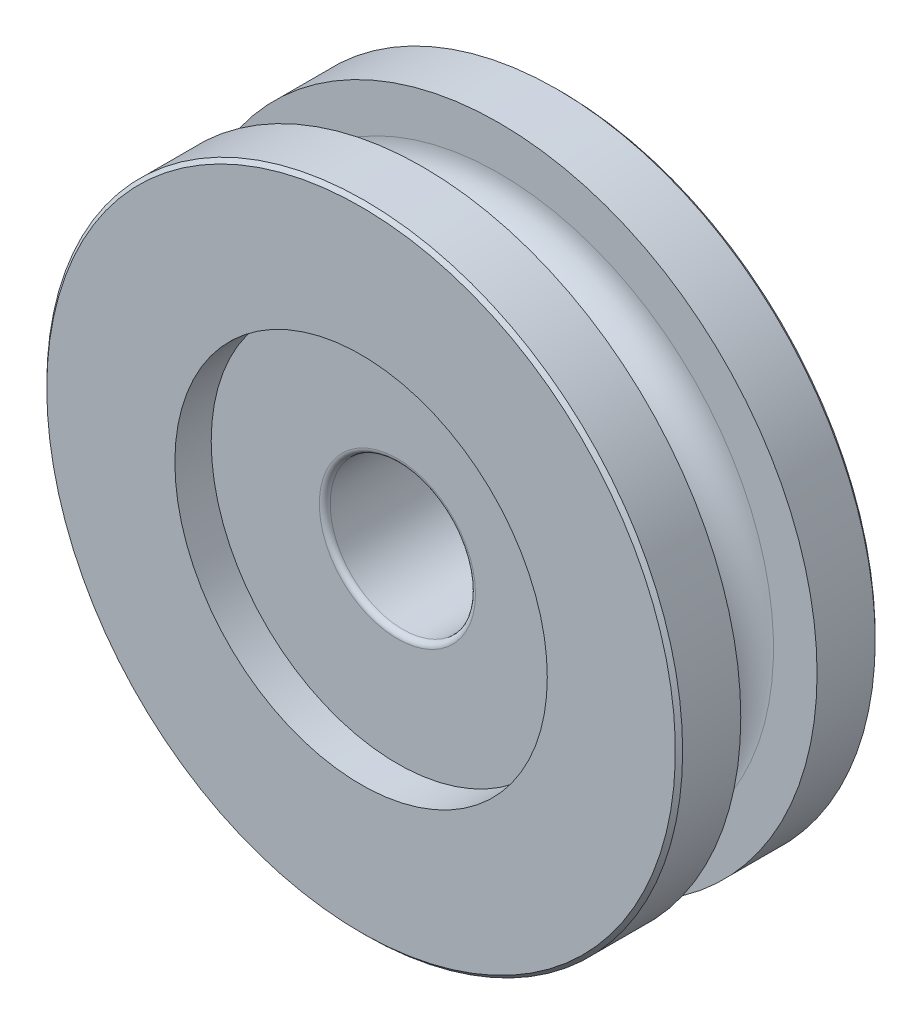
ISO-10303-21;
HEADER;
FILE_DESCRIPTION(('STEP AP214'),'2;1');
FILE_NAME('part.step','',(''),(''),'','','');
FILE_SCHEMA(('AUTOMOTIVE_DESIGN { 1 0 10303 214 1 1 1 1 }'));
ENDSEC;
DATA;
#1=APPLICATION_CONTEXT('core data for automotive mechanical design processes');
#2=APPLICATION_PROTOCOL_DEFINITION('international standard','automotive_design',2000,#1);
#3=PRODUCT_CONTEXT('',#1,'mechanical');
#4=PRODUCT('Part','Part','',(#3));
#5=PRODUCT_RELATED_PRODUCT_CATEGORY('part','',(#4));
#6=PRODUCT_DEFINITION_FORMATION('','',#4);
#7=PRODUCT_DEFINITION_CONTEXT('part definition',#1,'design');
#8=PRODUCT_DEFINITION('design','',#6,#7);
#9=PRODUCT_DEFINITION_SHAPE('','',#8);
#10=(LENGTH_UNIT() NAMED_UNIT(*) SI_UNIT(.MILLI.,.METRE.));
#11=(NAMED_UNIT(*) PLANE_ANGLE_UNIT() SI_UNIT($,.RADIAN.));
#12=(NAMED_UNIT(*) SI_UNIT($,.STERADIAN.) SOLID_ANGLE_UNIT());
#13=UNCERTAINTY_MEASURE_WITH_UNIT(LENGTH_MEASURE(1.E-05),#10,'distance_accuracy_value','');
#14=(GEOMETRIC_REPRESENTATION_CONTEXT(3) GLOBAL_UNCERTAINTY_ASSIGNED_CONTEXT((#13)) GLOBAL_UNIT_ASSIGNED_CONTEXT((#10,
#11,#12)) REPRESENTATION_CONTEXT('',''));
#15=CARTESIAN_POINT('',(0.,0.,0.));
#16=DIRECTION('',(0.,0.,1.));
#17=DIRECTION('',(1.,0.,0.));
#18=AXIS2_PLACEMENT_3D('',#15,#16,#17);
#19=CARTESIAN_POINT('',(0.,4.3,-3.5));
#20=DIRECTION('',(0.,0.,1.));
#21=DIRECTION('',(1.,0.,0.));
#22=AXIS2_PLACEMENT_3D('',#19,#20,#21);
#23=PLANE('',#22);
#24=CARTESIAN_POINT('',(2.4,-9.28614557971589,-3.5));
#25=DIRECTION('',(0.,0.,1.));
#26=DIRECTION('',(1.,0.,0.));
#27=AXIS2_PLACEMENT_3D('',#24,#25,#26);
#28=CIRCLE('',#27,1.);
#29=CARTESIAN_POINT('',(3.4,-9.28614557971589,-3.5));
#30=VERTEX_POINT('',#29);
#31=EDGE_CURVE('E127',#30,#30,#28,.T.);
#32=ORIENTED_EDGE('',*,*,#31,.F.);
#33=EDGE_LOOP('',(#32));
#34=FACE_BOUND('',#33,.T.);
#35=ADVANCED_FACE('F14',(#34),#23,.F.);
#36=CARTESIAN_POINT('',(-2.4,-9.28614557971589,-3.5));
#37=DIRECTION('',(0.,0.,-1.));
#38=DIRECTION('',(1.,0.,0.));
#39=AXIS2_PLACEMENT_3D('',#36,#37,#38);
#40=CIRCLE('',#39,1.);
#41=CARTESIAN_POINT('',(-1.4,-9.28614557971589,-3.5));
#42=VERTEX_POINT('',#41);
#43=EDGE_CURVE('E111',#42,#42,#40,.T.);
#44=ORIENTED_EDGE('',*,*,#43,.T.);
#45=EDGE_LOOP('',(#44));
#46=FACE_BOUND('',#45,.T.);
#47=ADVANCED_FACE('F239',(#46),#23,.F.);
#48=CARTESIAN_POINT('',(0.,15.1,2.1));
#49=DIRECTION('',(0.,0.,-1.));
#50=DIRECTION('',(-1.,0.,0.));
#51=AXIS2_PLACEMENT_3D('',#48,#49,#50);
#52=PLANE('',#51);
#53=CARTESIAN_POINT('',(0.,0.,2.1));
#54=DIRECTION('',(0.,0.,-1.));
#55=DIRECTION('',(-1.,0.,0.));
#56=AXIS2_PLACEMENT_3D('',#53,#54,#55);
#57=CIRCLE('',#56,17.5);
#58=CARTESIAN_POINT('',(-17.5,0.,2.1));
#59=VERTEX_POINT('',#58);
#60=EDGE_CURVE('E150',#59,#59,#57,.T.);
#61=ORIENTED_EDGE('',*,*,#60,.T.);
#62=EDGE_LOOP('',(#61));
#63=FACE_BOUND('',#62,.T.);
#64=CARTESIAN_POINT('',(0.,0.,2.1));
#65=DIRECTION('',(0.,0.,-1.));
#66=DIRECTION('',(-1.,0.,0.));
#67=AXIS2_PLACEMENT_3D('',#64,#65,#66);
#68=CIRCLE('',#67,15.1);
#69=CARTESIAN_POINT('',(-15.1,0.,2.1));
#70=VERTEX_POINT('',#69);
#71=EDGE_CURVE('E153',#70,#70,#68,.T.);
#72=ORIENTED_EDGE('',*,*,#71,.F.);
#73=EDGE_LOOP('',(#72));
#74=FACE_BOUND('',#73,.T.);
#75=ADVANCED_FACE('F233',(#63,#74),#52,.T.);
#76=CARTESIAN_POINT('',(0.,0.,-3.2));
#77=DIRECTION('',(0.,0.,-1.));
#78=DIRECTION('',(-1.,0.,0.));
#79=AXIS2_PLACEMENT_3D('',#76,#77,#78);
#80=CYLINDRICAL_SURFACE('',#79,17.5);
#81=CARTESIAN_POINT('',(0.,0.,5.3));
#82=DIRECTION('',(0.,0.,-1.));
#83=DIRECTION('',(-1.,0.,0.));
#84=AXIS2_PLACEMENT_3D('',#81,#82,#83);
#85=CIRCLE('',#84,17.5);
#86=CARTESIAN_POINT('',(-17.5,0.,5.3));
#87=VERTEX_POINT('',#86);
#88=EDGE_CURVE('E147',#87,#87,#85,.T.);
#89=ORIENTED_EDGE('',*,*,#88,.T.);
#90=EDGE_LOOP('',(#89));
#91=FACE_BOUND('',#90,.T.);
#92=ORIENTED_EDGE('',*,*,#60,.F.);
#93=EDGE_LOOP('',(#92));
#94=FACE_BOUND('',#93,.T.);
#95=ADVANCED_FACE('F230',(#91,#94),#80,.T.);
#96=CARTESIAN_POINT('',(0.,0.,0.));
#97=DIRECTION('',(0.,0.,-1.));
#98=DIRECTION('',(-1.,0.,0.));
#99=AXIS2_PLACEMENT_3D('',#96,#97,#98);
#100=TOROIDAL_SURFACE('',#99,15.1,2.1);
#101=ORIENTED_EDGE('',*,*,#71,.T.);
#102=EDGE_LOOP('',(#101));
#103=FACE_BOUND('',#102,.T.);
#104=CARTESIAN_POINT('',(0.,0.,-2.1));
#105=DIRECTION('',(0.,0.,-1.));
#106=DIRECTION('',(-1.,0.,0.));
#107=AXIS2_PLACEMENT_3D('',#104,#105,#106);
#108=CIRCLE('',#107,15.1);
#109=CARTESIAN_POINT('',(-15.1,0.,-2.1));
#110=VERTEX_POINT('',#109);
#111=EDGE_CURVE('E156',#110,#110,#108,.T.);
#112=ORIENTED_EDGE('',*,*,#111,.F.);
#113=EDGE_LOOP('',(#112));
#114=FACE_BOUND('',#113,.T.);
#115=ADVANCED_FACE('F226',(#103,#114),#100,.F.);
#116=CARTESIAN_POINT('',(0.,0.,5.3));
#117=DIRECTION('',(0.,0.,-1.));
#118=DIRECTION('',(-1.,0.,0.));
#119=AXIS2_PLACEMENT_3D('',#116,#117,#118);
#120=CONICAL_SURFACE('',#119,17.5,0.785398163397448);
#121=CARTESIAN_POINT('',(0.,0.,5.5));
#122=DIRECTION('',(0.,0.,-1.));
#123=DIRECTION('',(-1.,0.,0.));
#124=AXIS2_PLACEMENT_3D('',#121,#122,#123);
#125=CIRCLE('',#124,17.3);
#126=CARTESIAN_POINT('',(-17.3,0.,5.5));
#127=VERTEX_POINT('',#126);
#128=EDGE_CURVE('E144',#127,#127,#125,.T.);
#129=ORIENTED_EDGE('',*,*,#128,.T.);
#130=EDGE_LOOP('',(#129));
#131=FACE_BOUND('',#130,.T.);
#132=ORIENTED_EDGE('',*,*,#88,.F.);
#133=EDGE_LOOP('',(#132));
#134=FACE_BOUND('',#133,.T.);
#135=ADVANCED_FACE('F223',(#131,#134),#120,.T.);
#136=CARTESIAN_POINT('',(0.,15.1,-2.1));
#137=DIRECTION('',(0.,0.,1.));
#138=DIRECTION('',(1.,0.,0.));
#139=AXIS2_PLACEMENT_3D('',#136,#137,#138);
#140=PLANE('',#139);
#141=ORIENTED_EDGE('',*,*,#111,.T.);
#142=EDGE_LOOP('',(#141));
#143=FACE_BOUND('',#142,.T.);
#144=CARTESIAN_POINT('',(0.,0.,-2.1));
#145=DIRECTION('',(0.,0.,-1.));
#146=DIRECTION('',(-1.,0.,0.));
#147=AXIS2_PLACEMENT_3D('',#144,#145,#146);
#148=CIRCLE('',#147,17.5);
#149=CARTESIAN_POINT('',(-17.5,0.,-2.1));
#150=VERTEX_POINT('',#149);
#151=EDGE_CURVE('E159',#150,#150,#148,.T.);
#152=ORIENTED_EDGE('',*,*,#151,.F.);
#153=EDGE_LOOP('',(#152));
#154=FACE_BOUND('',#153,.T.);
#155=ADVANCED_FACE('F219',(#143,#154),#140,.T.);
#156=CARTESIAN_POINT('',(0.,10.25,5.5));
#157=DIRECTION('',(0.,0.,1.));
#158=DIRECTION('',(1.,0.,0.));
#159=AXIS2_PLACEMENT_3D('',#156,#157,#158);
#160=PLANE('',#159);
#161=CARTESIAN_POINT('',(0.,0.,5.5));
#162=DIRECTION('',(0.,0.,-1.));
#163=DIRECTION('',(-1.,0.,0.));
#164=AXIS2_PLACEMENT_3D('',#161,#162,#163);
#165=CIRCLE('',#164,10.25);
#166=CARTESIAN_POINT('',(-10.25,0.,5.5));
#167=VERTEX_POINT('',#166);
#168=EDGE_CURVE('E141',#167,#167,#165,.T.);
#169=ORIENTED_EDGE('',*,*,#168,.T.);
#170=EDGE_LOOP('',(#169));
#171=FACE_BOUND('',#170,.T.);
#172=ORIENTED_EDGE('',*,*,#128,.F.);
#173=EDGE_LOOP('',(#172));
#174=FACE_BOUND('',#173,.T.);
#175=ADVANCED_FACE('F216',(#171,#174),#160,.T.);
#176=CARTESIAN_POINT('',(0.,0.,-3.2));
#177=DIRECTION('',(0.,0.,-1.));
#178=DIRECTION('',(-1.,0.,0.));
#179=AXIS2_PLACEMENT_3D('',#176,#177,#178);
#180=CYLINDRICAL_SURFACE('',#179,17.5);
#181=ORIENTED_EDGE('',*,*,#151,.T.);
#182=EDGE_LOOP('',(#181));
#183=FACE_BOUND('',#182,.T.);
#184=CARTESIAN_POINT('',(0.,0.,-5.3));
#185=DIRECTION('',(0.,0.,-1.));
#186=DIRECTION('',(-1.,0.,0.));
#187=AXIS2_PLACEMENT_3D('',#184,#185,#186);
#188=CIRCLE('',#187,17.5);
#189=CARTESIAN_POINT('',(-17.5,0.,-5.3));
#190=VERTEX_POINT('',#189);
#191=EDGE_CURVE('E162',#190,#190,#188,.T.);
#192=ORIENTED_EDGE('',*,*,#191,.F.);
#193=EDGE_LOOP('',(#192));
#194=FACE_BOUND('',#193,.T.);
#195=ADVANCED_FACE('F212',(#183,#194),#180,.T.);
#196=CARTESIAN_POINT('',(0.,0.,7.5));
#197=DIRECTION('',(0.,0.,1.));
#198=DIRECTION('',(1.,0.,0.));
#199=AXIS2_PLACEMENT_3D('',#196,#197,#198);
#200=CYLINDRICAL_SURFACE('',#199,10.25);
#201=CARTESIAN_POINT('',(0.,0.,3.5));
#202=DIRECTION('',(0.,0.,1.));
#203=DIRECTION('',(1.,0.,0.));
#204=AXIS2_PLACEMENT_3D('',#201,#202,#203);
#205=CIRCLE('',#204,10.25);
#206=CARTESIAN_POINT('',(10.25,0.,3.5));
#207=VERTEX_POINT('',#206);
#208=EDGE_CURVE('E182',#207,#207,#205,.T.);
#209=ORIENTED_EDGE('',*,*,#208,.F.);
#210=EDGE_LOOP('',(#209));
#211=FACE_BOUND('',#210,.T.);
#212=ORIENTED_EDGE('',*,*,#168,.F.);
#213=EDGE_LOOP('',(#212));
#214=FACE_BOUND('',#213,.T.);
#215=ADVANCED_FACE('F209',(#211,#214),#200,.F.);
#216=CARTESIAN_POINT('',(0.,0.,-5.5));
#217=DIRECTION('',(0.,0.,1.));
#218=DIRECTION('',(1.,0.,0.));
#219=AXIS2_PLACEMENT_3D('',#216,#217,#218);
#220=CONICAL_SURFACE('',#219,17.3,0.785398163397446);
#221=ORIENTED_EDGE('',*,*,#191,.T.);
#222=EDGE_LOOP('',(#221));
#223=FACE_BOUND('',#222,.T.);
#224=CARTESIAN_POINT('',(0.,0.,-5.5));
#225=DIRECTION('',(0.,0.,-1.));
#226=DIRECTION('',(-1.,0.,0.));
#227=AXIS2_PLACEMENT_3D('',#224,#225,#226);
#228=CIRCLE('',#227,17.3);
#229=CARTESIAN_POINT('',(-17.3,0.,-5.5));
#230=VERTEX_POINT('',#229);
#231=EDGE_CURVE('E165',#230,#230,#228,.T.);
#232=ORIENTED_EDGE('',*,*,#231,.F.);
#233=EDGE_LOOP('',(#232));
#234=FACE_BOUND('',#233,.T.);
#235=ADVANCED_FACE('F205',(#223,#234),#220,.T.);
#236=CARTESIAN_POINT('',(0.,10.25,3.5));
#237=DIRECTION('',(0.,0.,-1.));
#238=DIRECTION('',(-1.,0.,0.));
#239=AXIS2_PLACEMENT_3D('',#236,#237,#238);
#240=PLANE('',#239);
#241=CARTESIAN_POINT('',(0.,0.,3.5));
#242=DIRECTION('',(0.,0.,1.));
#243=DIRECTION('',(1.,0.,0.));
#244=AXIS2_PLACEMENT_3D('',#241,#242,#243);
#245=CIRCLE('',#244,4.3);
#246=CARTESIAN_POINT('',(4.3,0.,3.5));
#247=VERTEX_POINT('',#246);
#248=EDGE_CURVE('E179',#247,#247,#245,.T.);
#249=ORIENTED_EDGE('',*,*,#248,.F.);
#250=EDGE_LOOP('',(#249));
#251=FACE_BOUND('',#250,.T.);
#252=ORIENTED_EDGE('',*,*,#208,.T.);
#253=EDGE_LOOP('',(#252));
#254=FACE_BOUND('',#253,.T.);
#255=ADVANCED_FACE('F202',(#251,#254),#240,.F.);
#256=CARTESIAN_POINT('',(0.,17.3,-5.5));
#257=DIRECTION('',(0.,0.,-1.));
#258=DIRECTION('',(-1.,0.,0.));
#259=AXIS2_PLACEMENT_3D('',#256,#257,#258);
#260=PLANE('',#259);
#261=ORIENTED_EDGE('',*,*,#231,.T.);
#262=EDGE_LOOP('',(#261));
#263=FACE_BOUND('',#262,.T.);
#264=CARTESIAN_POINT('',(0.,0.,-5.5));
#265=DIRECTION('',(0.,0.,-1.));
#266=DIRECTION('',(-1.,0.,0.));
#267=AXIS2_PLACEMENT_3D('',#264,#265,#266);
#268=CIRCLE('',#267,11.);
#269=CARTESIAN_POINT('',(-11.,0.,-5.5));
#270=VERTEX_POINT('',#269);
#271=EDGE_CURVE('E168',#270,#270,#268,.T.);
#272=ORIENTED_EDGE('',*,*,#271,.F.);
#273=EDGE_LOOP('',(#272));
#274=FACE_BOUND('',#273,.T.);
#275=ADVANCED_FACE('F199',(#263,#274),#260,.T.);
#276=CARTESIAN_POINT('',(0.,0.,3.2));
#277=DIRECTION('',(0.,0.,1.));
#278=DIRECTION('',(1.,0.,0.));
#279=AXIS2_PLACEMENT_3D('',#276,#277,#278);
#280=TOROIDAL_SURFACE('',#279,4.3,0.299999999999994);
#281=CARTESIAN_POINT('',(0.,0.,3.2));
#282=DIRECTION('',(0.,0.,1.));
#283=DIRECTION('',(1.,0.,0.));
#284=AXIS2_PLACEMENT_3D('',#281,#282,#283);
#285=CIRCLE('',#284,4.);
#286=CARTESIAN_POINT('',(4.,0.,3.2));
#287=VERTEX_POINT('',#286);
#288=EDGE_CURVE('E131',#287,#287,#285,.T.);
#289=ORIENTED_EDGE('',*,*,#288,.F.);
#290=EDGE_LOOP('',(#289));
#291=FACE_BOUND('',#290,.T.);
#292=ORIENTED_EDGE('',*,*,#248,.T.);
#293=EDGE_LOOP('',(#292));
#294=FACE_BOUND('',#293,.T.);
#295=ADVANCED_FACE('F16',(#291,#294),#280,.T.);
#296=CARTESIAN_POINT('',(0.,0.,-3.2));
#297=DIRECTION('',(0.,0.,-1.));
#298=DIRECTION('',(-1.,0.,0.));
#299=AXIS2_PLACEMENT_3D('',#296,#297,#298);
#300=CYLINDRICAL_SURFACE('',#299,11.);
#301=ORIENTED_EDGE('',*,*,#271,.T.);
#302=EDGE_LOOP('',(#301));
#303=FACE_BOUND('',#302,.T.);
#304=CARTESIAN_POINT('',(0.,0.,-4.65));
#305=DIRECTION('',(0.,0.,-1.));
#306=DIRECTION('',(-1.,0.,0.));
#307=AXIS2_PLACEMENT_3D('',#304,#305,#306);
#308=CIRCLE('',#307,11.);
#309=CARTESIAN_POINT('',(-11.,0.,-4.65));
#310=VERTEX_POINT('',#309);
#311=EDGE_CURVE('E171',#310,#310,#308,.T.);
#312=ORIENTED_EDGE('',*,*,#311,.F.);
#313=EDGE_LOOP('',(#312));
#314=FACE_BOUND('',#313,.T.);
#315=ADVANCED_FACE('F198',(#303,#314),#300,.F.);
#316=CARTESIAN_POINT('',(0.,0.,7.5));
#317=DIRECTION('',(0.,0.,1.));
#318=DIRECTION('',(1.,0.,0.));
#319=AXIS2_PLACEMENT_3D('',#316,#317,#318);
#320=CYLINDRICAL_SURFACE('',#319,4.);
#321=CARTESIAN_POINT('',(0.,0.,-3.2));
#322=DIRECTION('',(0.,0.,1.));
#323=DIRECTION('',(1.,0.,0.));
#324=AXIS2_PLACEMENT_3D('',#321,#322,#323);
#325=CIRCLE('',#324,4.);
#326=CARTESIAN_POINT('',(4.,0.,-3.2));
#327=VERTEX_POINT('',#326);
#328=EDGE_CURVE('E188',#327,#327,#325,.T.);
#329=ORIENTED_EDGE('',*,*,#328,.F.);
#330=EDGE_LOOP('',(#329));
#331=FACE_BOUND('',#330,.T.);
#332=ORIENTED_EDGE('',*,*,#288,.T.);
#333=EDGE_LOOP('',(#332));
#334=FACE_BOUND('',#333,.T.);
#335=ADVANCED_FACE('F194',(#331,#334),#320,.F.);
#336=CARTESIAN_POINT('',(0.,11.,-4.65));
#337=DIRECTION('',(0.,0.,1.));
#338=DIRECTION('',(1.,0.,0.));
#339=AXIS2_PLACEMENT_3D('',#336,#337,#338);
#340=PLANE('',#339);
#341=ORIENTED_EDGE('',*,*,#311,.T.);
#342=EDGE_LOOP('',(#341));
#343=FACE_BOUND('',#342,.T.);
#344=CARTESIAN_POINT('',(0.,0.,-4.65));
#345=DIRECTION('',(0.,0.,-1.));
#346=DIRECTION('',(-1.,0.,0.));
#347=AXIS2_PLACEMENT_3D('',#344,#345,#346);
#348=CIRCLE('',#347,11.5);
#349=CARTESIAN_POINT('',(-11.5,0.,-4.65));
#350=VERTEX_POINT('',#349);
#351=EDGE_CURVE('E174',#350,#350,#348,.T.);
#352=ORIENTED_EDGE('',*,*,#351,.F.);
#353=EDGE_LOOP('',(#352));
#354=FACE_BOUND('',#353,.T.);
#355=ADVANCED_FACE('F273',(#343,#354),#340,.T.);
#356=CARTESIAN_POINT('',(0.,0.,-3.2));
#357=DIRECTION('',(0.,0.,-1.));
#358=DIRECTION('',(-1.,0.,0.));
#359=AXIS2_PLACEMENT_3D('',#356,#357,#358);
#360=CYLINDRICAL_SURFACE('',#359,11.5);
#361=ORIENTED_EDGE('',*,*,#351,.T.);
#362=EDGE_LOOP('',(#361));
#363=FACE_BOUND('',#362,.T.);
#364=DIRECTION('',(0.,0.,-1.));
#365=VECTOR('',#364,1.);
#366=CARTESIAN_POINT('',(1.16498191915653,-11.440839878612,-3.2));
#367=LINE('',#366,#365);
#368=CARTESIAN_POINT('',(1.16498191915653,-11.440839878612,-4.5));
#369=VERTEX_POINT('',#368);
#370=CARTESIAN_POINT('',(1.16498191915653,-11.440839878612,-3.5));
#371=VERTEX_POINT('',#370);
#372=EDGE_CURVE('E18',#369,#371,#367,.F.);
#373=ORIENTED_EDGE('',*,*,#372,.F.);
#374=CARTESIAN_POINT('',(0.,0.,-4.5));
#375=DIRECTION('',(0.,0.,-1.));
#376=DIRECTION('',(-1.,0.,0.));
#377=AXIS2_PLACEMENT_3D('',#374,#375,#376);
#378=CIRCLE('',#377,11.5);
#379=CARTESIAN_POINT('',(-1.16498191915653,-11.440839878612,-4.5));
#380=VERTEX_POINT('',#379);
#381=EDGE_CURVE('E9',#369,#380,#378,.F.);
#382=ORIENTED_EDGE('',*,*,#381,.T.);
#383=DIRECTION('',(0.,0.,-1.));
#384=VECTOR('',#383,1.);
#385=CARTESIAN_POINT('',(-1.16498191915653,-11.440839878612,-3.2));
#386=LINE('',#385,#384);
#387=CARTESIAN_POINT('',(-1.16498191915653,-11.440839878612,-3.5));
#388=VERTEX_POINT('',#387);
#389=EDGE_CURVE('E138',#388,#380,#386,.T.);
#390=ORIENTED_EDGE('',*,*,#389,.F.);
#391=CARTESIAN_POINT('',(0.,0.,-3.5));
#392=DIRECTION('',(0.,0.,-1.));
#393=DIRECTION('',(-1.,0.,0.));
#394=AXIS2_PLACEMENT_3D('',#391,#392,#393);
#395=CIRCLE('',#394,11.5);
#396=EDGE_CURVE('E177',#371,#388,#395,.T.);
#397=ORIENTED_EDGE('',*,*,#396,.F.);
#398=EDGE_LOOP('',(#373,#382,#390,#397));
#399=FACE_BOUND('',#398,.T.);
#400=ADVANCED_FACE('F276',(#363,#399),#360,.F.);
#401=CARTESIAN_POINT('',(0.,0.,-3.2));
#402=DIRECTION('',(0.,0.,1.));
#403=DIRECTION('',(1.,0.,0.));
#404=AXIS2_PLACEMENT_3D('',#401,#402,#403);
#405=TOROIDAL_SURFACE('',#404,4.3,0.300000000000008);
#406=CARTESIAN_POINT('',(0.,0.,-3.5));
#407=DIRECTION('',(0.,0.,1.));
#408=DIRECTION('',(1.,0.,0.));
#409=AXIS2_PLACEMENT_3D('',#406,#407,#408);
#410=CIRCLE('',#409,4.3);
#411=CARTESIAN_POINT('',(4.3,0.,-3.5));
#412=VERTEX_POINT('',#411);
#413=EDGE_CURVE('E185',#412,#412,#410,.T.);
#414=ORIENTED_EDGE('',*,*,#413,.F.);
#415=EDGE_LOOP('',(#414));
#416=FACE_BOUND('',#415,.T.);
#417=ORIENTED_EDGE('',*,*,#328,.T.);
#418=EDGE_LOOP('',(#417));
#419=FACE_BOUND('',#418,.T.);
#420=ADVANCED_FACE('F281',(#416,#419),#405,.T.);
#421=ORIENTED_EDGE('',*,*,#413,.T.);
#422=EDGE_LOOP('',(#421));
#423=FACE_BOUND('',#422,.T.);
#424=CARTESIAN_POINT('',(2.4,-9.28614557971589,-3.5));
#425=DIRECTION('',(0.,0.,1.));
#426=DIRECTION('',(1.,0.,0.));
#427=AXIS2_PLACEMENT_3D('',#424,#425,#426);
#428=CIRCLE('',#427,1.7);
#429=CARTESIAN_POINT('',(3.29136923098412,-7.83857489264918,-3.5));
#430=VERTEX_POINT('',#429);
#431=CARTESIAN_POINT('',(0.746119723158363,-9.67943940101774,-3.5));
#432=VERTEX_POINT('',#431);
#433=EDGE_CURVE('E374',#430,#432,#428,.T.);
#434=ORIENTED_EDGE('',*,*,#433,.T.);
#435=DIRECTION('',(0.231349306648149,-0.972870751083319,0.));
#436=VECTOR('',#435,1.);
#437=CARTESIAN_POINT('',(0.746119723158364,-9.67943940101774,-3.5));
#438=LINE('',#437,#436);
#439=EDGE_CURVE('E29',#432,#371,#438,.T.);
#440=ORIENTED_EDGE('',*,*,#439,.T.);
#441=ORIENTED_EDGE('',*,*,#396,.T.);
#442=DIRECTION('',(0.231349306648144,0.97287075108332,0.));
#443=VECTOR('',#442,1.);
#444=CARTESIAN_POINT('',(-0.746119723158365,-9.67943940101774,-3.5));
#445=LINE('',#444,#443);
#446=CARTESIAN_POINT('',(-0.746119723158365,-9.67943940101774,-3.5));
#447=VERTEX_POINT('',#446);
#448=EDGE_CURVE('E356',#388,#447,#445,.T.);
#449=ORIENTED_EDGE('',*,*,#448,.T.);
#450=CARTESIAN_POINT('',(-2.4,-9.28614557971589,-3.5));
#451=DIRECTION('',(0.,0.,1.));
#452=DIRECTION('',(-1.,0.,0.));
#453=AXIS2_PLACEMENT_3D('',#450,#451,#452);
#454=CIRCLE('',#453,1.7);
#455=CARTESIAN_POINT('',(-3.29136923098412,-7.83857489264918,-3.5));
#456=VERTEX_POINT('',#455);
#457=EDGE_CURVE('E360',#447,#456,#454,.T.);
#458=ORIENTED_EDGE('',*,*,#457,.T.);
#459=DIRECTION('',(-0.851512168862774,-0.524334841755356,0.));
#460=VECTOR('',#459,1.);
#461=CARTESIAN_POINT('',(-3.29136923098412,-7.83857489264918,-3.5));
#462=LINE('',#461,#460);
#463=CARTESIAN_POINT('',(-5.24892182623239,-9.04397520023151,-3.5));
#464=VERTEX_POINT('',#463);
#465=EDGE_CURVE('E137',#456,#464,#462,.T.);
#466=ORIENTED_EDGE('',*,*,#465,.T.);
#467=CARTESIAN_POINT('',(0.,-0.65,-3.5));
#468=DIRECTION('',(0.,0.,-1.));
#469=DIRECTION('',(0.,-1.,0.));
#470=AXIS2_PLACEMENT_3D('',#467,#468,#469);
#471=CIRCLE('',#470,9.9);
#472=CARTESIAN_POINT('',(5.2489218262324,-9.04397520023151,-3.5));
#473=VERTEX_POINT('',#472);
#474=EDGE_CURVE('E367',#464,#473,#471,.T.);
#475=ORIENTED_EDGE('',*,*,#474,.T.);
#476=DIRECTION('',(-0.851512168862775,0.524334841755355,0.));
#477=VECTOR('',#476,1.);
#478=CARTESIAN_POINT('',(3.29136923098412,-7.83857489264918,-3.5));
#479=LINE('',#478,#477);
#480=EDGE_CURVE('E370',#473,#430,#479,.T.);
#481=ORIENTED_EDGE('',*,*,#480,.T.);
#482=EDGE_LOOP('',(#434,#440,#441,#449,#458,#466,#475,#481));
#483=FACE_BOUND('',#482,.T.);
#484=ADVANCED_FACE('F287',(#423,#483),#23,.F.);
#485=CARTESIAN_POINT('',(0.,-0.65,-3.5));
#486=DIRECTION('',(0.,0.,1.));
#487=DIRECTION('',(-1.,0.,0.));
#488=AXIS2_PLACEMENT_3D('',#485,#486,#487);
#489=CYLINDRICAL_SURFACE('',#488,9.9);
#490=CARTESIAN_POINT('',(0.,-0.65,-4.5));
#491=DIRECTION('',(0.,0.,-1.));
#492=DIRECTION('',(0.,-1.,0.));
#493=AXIS2_PLACEMENT_3D('',#490,#491,#492);
#494=CIRCLE('',#493,9.9);
#495=CARTESIAN_POINT('',(-5.24892182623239,-9.04397520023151,-4.5));
#496=VERTEX_POINT('',#495);
#497=CARTESIAN_POINT('',(5.2489218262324,-9.04397520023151,-4.5));
#498=VERTEX_POINT('',#497);
#499=EDGE_CURVE('E343',#496,#498,#494,.T.);
#500=ORIENTED_EDGE('',*,*,#499,.T.);
#501=DIRECTION('',(0.,0.,-1.));
#502=VECTOR('',#501,1.);
#503=CARTESIAN_POINT('',(5.2489218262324,-9.04397520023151,-3.5));
#504=LINE('',#503,#502);
#505=EDGE_CURVE('E132',#473,#498,#504,.T.);
#506=ORIENTED_EDGE('',*,*,#505,.F.);
#507=ORIENTED_EDGE('',*,*,#474,.F.);
#508=DIRECTION('',(0.,0.,-1.));
#509=VECTOR('',#508,1.);
#510=CARTESIAN_POINT('',(-5.24892182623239,-9.04397520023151,-3.5));
#511=LINE('',#510,#509);
#512=EDGE_CURVE('E125',#464,#496,#511,.T.);
#513=ORIENTED_EDGE('',*,*,#512,.T.);
#514=EDGE_LOOP('',(#500,#506,#507,#513));
#515=FACE_BOUND('',#514,.T.);
#516=ADVANCED_FACE('F290',(#515),#489,.F.);
#517=CARTESIAN_POINT('',(3.29136923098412,-7.83857489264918,-3.5));
#518=DIRECTION('',(-0.524334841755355,-0.851512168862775,0.));
#519=DIRECTION('',(-0.851512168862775,0.524334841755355,0.));
#520=AXIS2_PLACEMENT_3D('',#517,#518,#519);
#521=PLANE('',#520);
#522=DIRECTION('',(-0.851512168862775,0.524334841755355,0.));
#523=VECTOR('',#522,1.);
#524=CARTESIAN_POINT('',(3.29136923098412,-7.83857489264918,-4.5));
#525=LINE('',#524,#523);
#526=CARTESIAN_POINT('',(3.29136923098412,-7.83857489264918,-4.5));
#527=VERTEX_POINT('',#526);
#528=EDGE_CURVE('E136',#498,#527,#525,.T.);
#529=ORIENTED_EDGE('',*,*,#528,.T.);
#530=DIRECTION('',(0.,0.,-1.));
#531=VECTOR('',#530,1.);
#532=CARTESIAN_POINT('',(3.29136923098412,-7.83857489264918,-3.5));
#533=LINE('',#532,#531);
#534=EDGE_CURVE('E102',#430,#527,#533,.T.);
#535=ORIENTED_EDGE('',*,*,#534,.F.);
#536=ORIENTED_EDGE('',*,*,#480,.F.);
#537=ORIENTED_EDGE('',*,*,#505,.T.);
#538=EDGE_LOOP('',(#529,#535,#536,#537));
#539=FACE_BOUND('',#538,.T.);
#540=ADVANCED_FACE('F292',(#539),#521,.F.);
#541=CARTESIAN_POINT('',(2.4,-9.28614557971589,-3.5));
#542=DIRECTION('',(0.,0.,1.));
#543=DIRECTION('',(-1.,0.,0.));
#544=AXIS2_PLACEMENT_3D('',#541,#542,#543);
#545=CYLINDRICAL_SURFACE('',#544,1.7);
#546=CARTESIAN_POINT('',(2.4,-9.28614557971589,-4.5));
#547=DIRECTION('',(0.,0.,1.));
#548=DIRECTION('',(1.,0.,0.));
#549=AXIS2_PLACEMENT_3D('',#546,#547,#548);
#550=CIRCLE('',#549,1.7);
#551=CARTESIAN_POINT('',(0.746119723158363,-9.67943940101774,-4.5));
#552=VERTEX_POINT('',#551);
#553=EDGE_CURVE('E96',#527,#552,#550,.T.);
#554=ORIENTED_EDGE('',*,*,#553,.T.);
#555=DIRECTION('',(0.,0.,-1.));
#556=VECTOR('',#555,1.);
#557=CARTESIAN_POINT('',(0.746119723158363,-9.67943940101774,-3.5));
#558=LINE('',#557,#556);
#559=EDGE_CURVE('E103',#432,#552,#558,.T.);
#560=ORIENTED_EDGE('',*,*,#559,.F.);
#561=ORIENTED_EDGE('',*,*,#433,.F.);
#562=ORIENTED_EDGE('',*,*,#534,.T.);
#563=EDGE_LOOP('',(#554,#560,#561,#562));
#564=FACE_BOUND('',#563,.T.);
#565=ADVANCED_FACE('F108',(#564),#545,.T.);
#566=CARTESIAN_POINT('',(-0.746119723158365,-9.67943940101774,-3.5));
#567=DIRECTION('',(-0.97287075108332,0.231349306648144,0.));
#568=DIRECTION('',(0.,0.,1.));
#569=AXIS2_PLACEMENT_3D('',#566,#567,#568);
#570=PLANE('',#569);
#571=ORIENTED_EDGE('',*,*,#448,.F.);
#572=ORIENTED_EDGE('',*,*,#389,.T.);
#573=DIRECTION('',(0.231349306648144,0.97287075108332,0.));
#574=VECTOR('',#573,1.);
#575=CARTESIAN_POINT('',(-0.746119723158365,-9.67943940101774,-4.5));
#576=LINE('',#575,#574);
#577=CARTESIAN_POINT('',(-0.746119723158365,-9.67943940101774,-4.5));
#578=VERTEX_POINT('',#577);
#579=EDGE_CURVE('E115',#380,#578,#576,.T.);
#580=ORIENTED_EDGE('',*,*,#579,.T.);
#581=DIRECTION('',(0.,0.,-1.));
#582=VECTOR('',#581,1.);
#583=CARTESIAN_POINT('',(-0.746119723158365,-9.67943940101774,-3.5));
#584=LINE('',#583,#582);
#585=EDGE_CURVE('E375',#447,#578,#584,.T.);
#586=ORIENTED_EDGE('',*,*,#585,.F.);
#587=EDGE_LOOP('',(#571,#572,#580,#586));
#588=FACE_BOUND('',#587,.T.);
#589=ADVANCED_FACE('F323',(#588),#570,.F.);
#590=CARTESIAN_POINT('',(-3.29136923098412,-7.83857489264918,-3.5));
#591=DIRECTION('',(0.524334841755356,-0.851512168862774,0.));
#592=DIRECTION('',(0.,0.,-1.));
#593=AXIS2_PLACEMENT_3D('',#590,#591,#592);
#594=PLANE('',#593);
#595=DIRECTION('',(-0.851512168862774,-0.524334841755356,0.));
#596=VECTOR('',#595,1.);
#597=CARTESIAN_POINT('',(-3.29136923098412,-7.83857489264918,-4.5));
#598=LINE('',#597,#596);
#599=CARTESIAN_POINT('',(-3.29136923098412,-7.83857489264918,-4.5));
#600=VERTEX_POINT('',#599);
#601=EDGE_CURVE('E140',#600,#496,#598,.T.);
#602=ORIENTED_EDGE('',*,*,#601,.T.);
#603=ORIENTED_EDGE('',*,*,#512,.F.);
#604=ORIENTED_EDGE('',*,*,#465,.F.);
#605=DIRECTION('',(0.,0.,-1.));
#606=VECTOR('',#605,1.);
#607=CARTESIAN_POINT('',(-3.29136923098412,-7.83857489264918,-3.5));
#608=LINE('',#607,#606);
#609=EDGE_CURVE('E338',#456,#600,#608,.T.);
#610=ORIENTED_EDGE('',*,*,#609,.T.);
#611=EDGE_LOOP('',(#602,#603,#604,#610));
#612=FACE_BOUND('',#611,.T.);
#613=ADVANCED_FACE('F319',(#612),#594,.F.);
#614=CARTESIAN_POINT('',(0.,-0.65,-4.5));
#615=DIRECTION('',(0.,0.,-1.));
#616=DIRECTION('',(0.,-1.,0.));
#617=AXIS2_PLACEMENT_3D('',#614,#615,#616);
#618=PLANE('',#617);
#619=CARTESIAN_POINT('',(2.4,-9.28614557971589,-4.5));
#620=DIRECTION('',(0.,0.,1.));
#621=DIRECTION('',(1.,0.,0.));
#622=AXIS2_PLACEMENT_3D('',#619,#620,#621);
#623=CIRCLE('',#622,1.);
#624=CARTESIAN_POINT('',(3.4,-9.28614557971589,-4.5));
#625=VERTEX_POINT('',#624);
#626=EDGE_CURVE('E346',#625,#625,#623,.T.);
#627=ORIENTED_EDGE('',*,*,#626,.T.);
#628=EDGE_LOOP('',(#627));
#629=FACE_BOUND('',#628,.T.);
#630=CARTESIAN_POINT('',(-2.4,-9.28614557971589,-4.5));
#631=DIRECTION('',(0.,0.,-1.));
#632=DIRECTION('',(1.,0.,0.));
#633=AXIS2_PLACEMENT_3D('',#630,#631,#632);
#634=CIRCLE('',#633,1.);
#635=CARTESIAN_POINT('',(-1.4,-9.28614557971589,-4.5));
#636=VERTEX_POINT('',#635);
#637=EDGE_CURVE('E130',#636,#636,#634,.T.);
#638=ORIENTED_EDGE('',*,*,#637,.F.);
#639=EDGE_LOOP('',(#638));
#640=FACE_BOUND('',#639,.T.);
#641=ORIENTED_EDGE('',*,*,#381,.F.);
#642=DIRECTION('',(0.231349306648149,-0.972870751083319,0.));
#643=VECTOR('',#642,1.);
#644=CARTESIAN_POINT('',(0.746119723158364,-9.67943940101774,-4.5));
#645=LINE('',#644,#643);
#646=EDGE_CURVE('E93',#552,#369,#645,.T.);
#647=ORIENTED_EDGE('',*,*,#646,.F.);
#648=ORIENTED_EDGE('',*,*,#553,.F.);
#649=ORIENTED_EDGE('',*,*,#528,.F.);
#650=ORIENTED_EDGE('',*,*,#499,.F.);
#651=ORIENTED_EDGE('',*,*,#601,.F.);
#652=CARTESIAN_POINT('',(-2.4,-9.28614557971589,-4.5));
#653=DIRECTION('',(0.,0.,1.));
#654=DIRECTION('',(-1.,0.,0.));
#655=AXIS2_PLACEMENT_3D('',#652,#653,#654);
#656=CIRCLE('',#655,1.7);
#657=EDGE_CURVE('E121',#578,#600,#656,.T.);
#658=ORIENTED_EDGE('',*,*,#657,.F.);
#659=ORIENTED_EDGE('',*,*,#579,.F.);
#660=EDGE_LOOP('',(#641,#647,#648,#649,#650,#651,#658,#659));
#661=FACE_BOUND('',#660,.T.);
#662=ADVANCED_FACE('F95',(#629,#640,#661),#618,.T.);
#663=CARTESIAN_POINT('',(2.4,-9.28614557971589,-3.5));
#664=DIRECTION('',(0.,0.,1.));
#665=DIRECTION('',(-1.,0.,0.));
#666=AXIS2_PLACEMENT_3D('',#663,#664,#665);
#667=CYLINDRICAL_SURFACE('',#666,1.);
#668=ORIENTED_EDGE('',*,*,#626,.F.);
#669=EDGE_LOOP('',(#668));
#670=FACE_BOUND('',#669,.T.);
#671=ORIENTED_EDGE('',*,*,#31,.T.);
#672=EDGE_LOOP('',(#671));
#673=FACE_BOUND('',#672,.T.);
#674=ADVANCED_FACE('F309',(#670,#673),#667,.F.);
#675=CARTESIAN_POINT('',(-2.4,-9.28614557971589,-3.5));
#676=DIRECTION('',(0.,0.,1.));
#677=DIRECTION('',(-1.,0.,0.));
#678=AXIS2_PLACEMENT_3D('',#675,#676,#677);
#679=CYLINDRICAL_SURFACE('',#678,1.);
#680=ORIENTED_EDGE('',*,*,#637,.T.);
#681=EDGE_LOOP('',(#680));
#682=FACE_BOUND('',#681,.T.);
#683=ORIENTED_EDGE('',*,*,#43,.F.);
#684=EDGE_LOOP('',(#683));
#685=FACE_BOUND('',#684,.T.);
#686=ADVANCED_FACE('F305',(#682,#685),#679,.F.);
#687=CARTESIAN_POINT('',(-2.4,-9.28614557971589,-3.5));
#688=DIRECTION('',(0.,0.,1.));
#689=DIRECTION('',(-1.,0.,0.));
#690=AXIS2_PLACEMENT_3D('',#687,#688,#689);
#691=CYLINDRICAL_SURFACE('',#690,1.7);
#692=ORIENTED_EDGE('',*,*,#657,.T.);
#693=ORIENTED_EDGE('',*,*,#609,.F.);
#694=ORIENTED_EDGE('',*,*,#457,.F.);
#695=ORIENTED_EDGE('',*,*,#585,.T.);
#696=EDGE_LOOP('',(#692,#693,#694,#695));
#697=FACE_BOUND('',#696,.T.);
#698=ADVANCED_FACE('F308',(#697),#691,.T.);
#699=CARTESIAN_POINT('',(0.746119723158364,-9.67943940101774,-3.5));
#700=DIRECTION('',(0.972870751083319,0.231349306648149,0.));
#701=DIRECTION('',(0.,0.,-1.));
#702=AXIS2_PLACEMENT_3D('',#699,#700,#701);
#703=PLANE('',#702);
#704=ORIENTED_EDGE('',*,*,#646,.T.);
#705=ORIENTED_EDGE('',*,*,#372,.T.);
#706=ORIENTED_EDGE('',*,*,#439,.F.);
#707=ORIENTED_EDGE('',*,*,#559,.T.);
#708=EDGE_LOOP('',(#704,#705,#706,#707));
#709=FACE_BOUND('',#708,.T.);
#710=ADVANCED_FACE('F113',(#709),#703,.F.);
#711=CLOSED_SHELL('',(#35,#47,#75,#95,#115,#135,#155,#175,#195,#215,#235,#255,#275,#295,#315,
#335,#355,#400,#420,#484,#516,#540,#565,#589,#613,#662,#674,#686,#698,#710));
#712=MANIFOLD_SOLID_BREP('B1',#711);
#713=ADVANCED_BREP_SHAPE_REPRESENTATION('',(#18,#712),#14);
#714=SHAPE_DEFINITION_REPRESENTATION(#9,#713);
ENDSEC;
END-ISO-10303-21;
